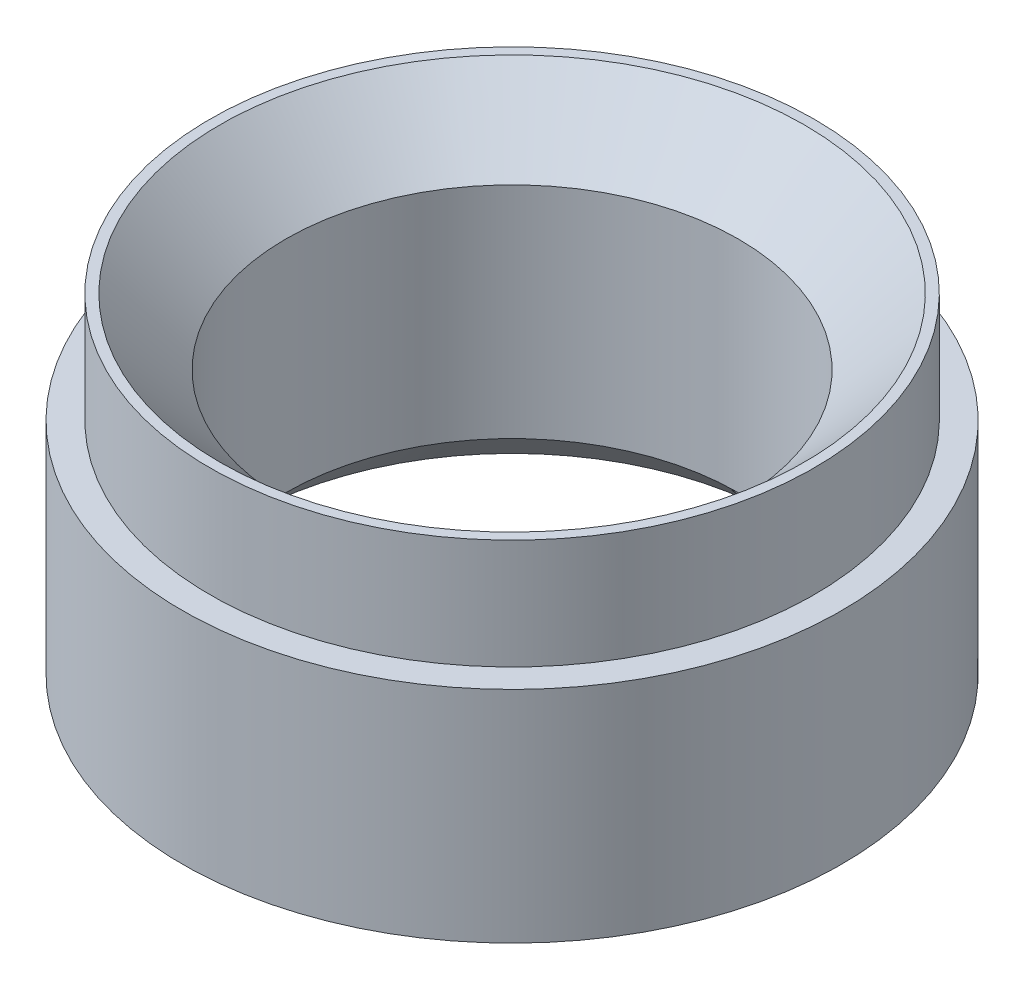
from build123d import *

# Parameters (mm, degrees)
CHAMFER2_SIZE      = 1.27
SKETCH2_R          = 0.889
CUT_EXTRUDE1_DEPTH = 4.7625
CIRPATTERN1_COUNT  = 2
CHAMFER3_SIZE      = 1.905


with BuildPart() as part:
    # Sketch1 → Revolve1 (revolve)
    with BuildSketch(Plane.XY, mode=Mode.PRIVATE) as revolve1_sk:
        Polygon((-6.5405, 0), (-8.73125, 0), (-8.73125, -3.175), (-9.525, -3.175), (-9.525, -9.525), (-6.5405, -9.525), align=None)
    revolve(revolve1_sk.sketch.rotate(Axis((0, 0, 0), (0, 1, 0)), 270), axis=Axis((0, 0, 0), (0, 1, 0)))

    # Chamfer2
    chamfer2_edges = [part.edges().sort_by_distance(p)[0] for p in [
        (0, -9.525, 6.5405),
    ]]
    chamfer(chamfer2_edges, length=CHAMFER2_SIZE)

    # Sketch2 → Cut-Extrude1 (cut)
    with BuildSketch(Plane.XZ.offset(9.525)):
        with Locations(Location((0, 7.62, 0), (0, 0, 270))):
            Circle(SKETCH2_R)
    cut_extrude1 = extrude(amount=-CUT_EXTRUDE1_DEPTH, mode=Mode.SUBTRACT)

    # CirPattern1: Cut-Extrude1 ×2 about axis
    cirpattern1_axis = Axis((0, 0, 0), (0, 1, 0))
    for i in range(1, CIRPATTERN1_COUNT):
        add(cut_extrude1.rotate(cirpattern1_axis, i * 360 / CIRPATTERN1_COUNT), mode=Mode.SUBTRACT)

    # Chamfer3
    chamfer3_edges = [part.edges().sort_by_distance(p)[0] for p in [
        (0, 0, 6.5405),
    ]]
    chamfer(chamfer3_edges, length=CHAMFER3_SIZE)


solid = part.part
